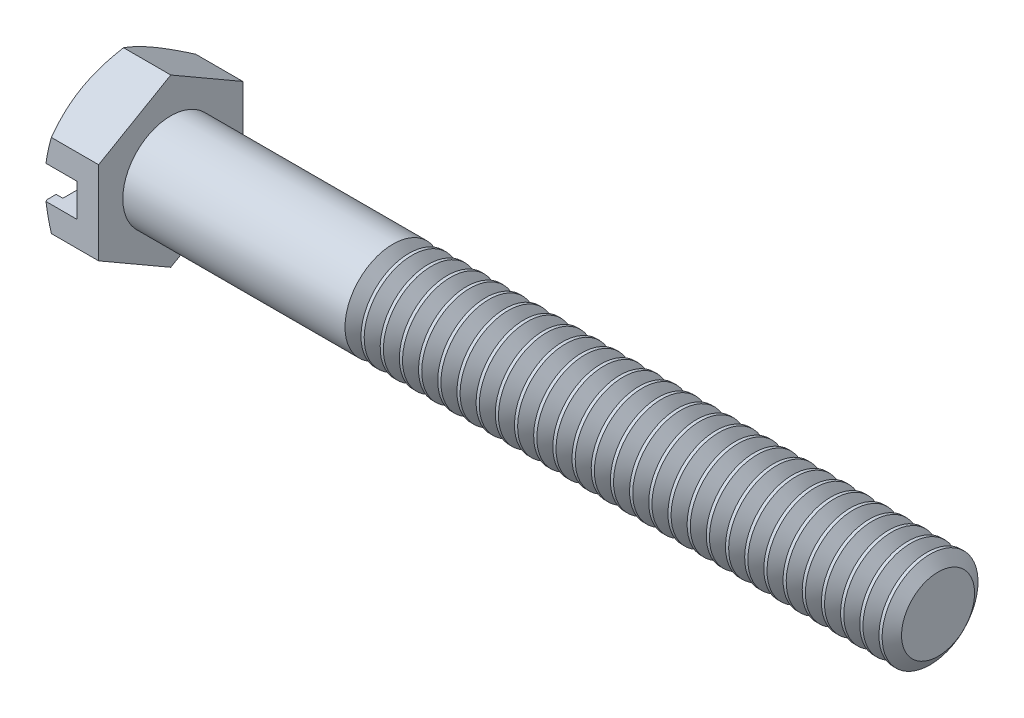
from build123d import *

# Parameters (mm, degrees)
SKETCH2_R       = 2.784614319
HEX_DIE_DEPTH   = 1.778
SKETCH3_W       = 5.51408776
SKETCH3_H       = 1.0922
SLOT_DEPTH      = 1.0668
SKETCH4_R       = 2.08915
INDENT_DEPTH    = 0.22225
THDSCHPAT_COUNT = 29
THDSCHPAT_PITCH = 0.635


with BuildPart() as part:
    # BodySke → Base-Revolve (revolve)
    with BuildSketch(Plane.XY, mode=Mode.PRIVATE) as base_revolve_sk:
        Polygon((1.778, 1.5875), (1.778, 2.75704388), (0.213298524, 2.75704388), (0, 2.3876), (0, 0), (27.178, 0), (27.178, 1.5875), align=None)
    revolve(base_revolve_sk.sketch.rotate(Axis((-25.4, 0, 0), (1, 0, 0)), 90), axis=Axis((-25.4, 0, 0), (1, 0, 0)))

    # Sketch2 → Hex-Die (cut)
    with BuildSketch(Plane(origin=(0, 0, 0), x_dir=(0, 0, -1), z_dir=(1, 0, 0))):
        Circle(SKETCH2_R)
        Polygon((-2.3876, 1.378481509), (0, 2.756963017), (2.3876, 1.378481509), (2.3876, -1.378481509), (0, -2.756963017), (-2.3876, -1.378481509), align=None, mode=Mode.SUBTRACT)
    extrude(amount=HEX_DIE_DEPTH, mode=Mode.SUBTRACT)

    # Sketch3 → Slot (cut)
    with BuildSketch(Plane(origin=(0, 0, 0), x_dir=(0, 0, -1), z_dir=(1, 0, 0))):
        Rectangle(SKETCH3_W, SKETCH3_H)
    extrude(amount=SLOT_DEPTH, mode=Mode.SUBTRACT)

    # Sketch4 → Indent (cut)
    with BuildSketch(Plane(origin=(0, 0, 0), x_dir=(0, 0, -1), z_dir=(1, 0, 0))):
        Circle(SKETCH4_R)
    extrude(amount=INDENT_DEPTH, mode=Mode.SUBTRACT)

    # ThdSchSke → ThreadSchematic (revolve, cut)
    with BuildSketch(Plane.XY):
        Polygon((9.398, -1.20904), (9.132999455, -1.5875), (9.132999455, -1.984375), (9.663000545, -1.984375), (9.663000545, -1.5875), align=None)
    threadschematic = revolve(axis=Axis((-3.175, 0, 0), (1, 0, 0)), mode=Mode.SUBTRACT)

    # ThdSchPat: ThreadSchematic ×29
    with Locations(*[(i * THDSCHPAT_PITCH, 0, 0) for i in range(1, THDSCHPAT_COUNT)]):
        add(threadschematic, mode=Mode.SUBTRACT)


solid = part.part
